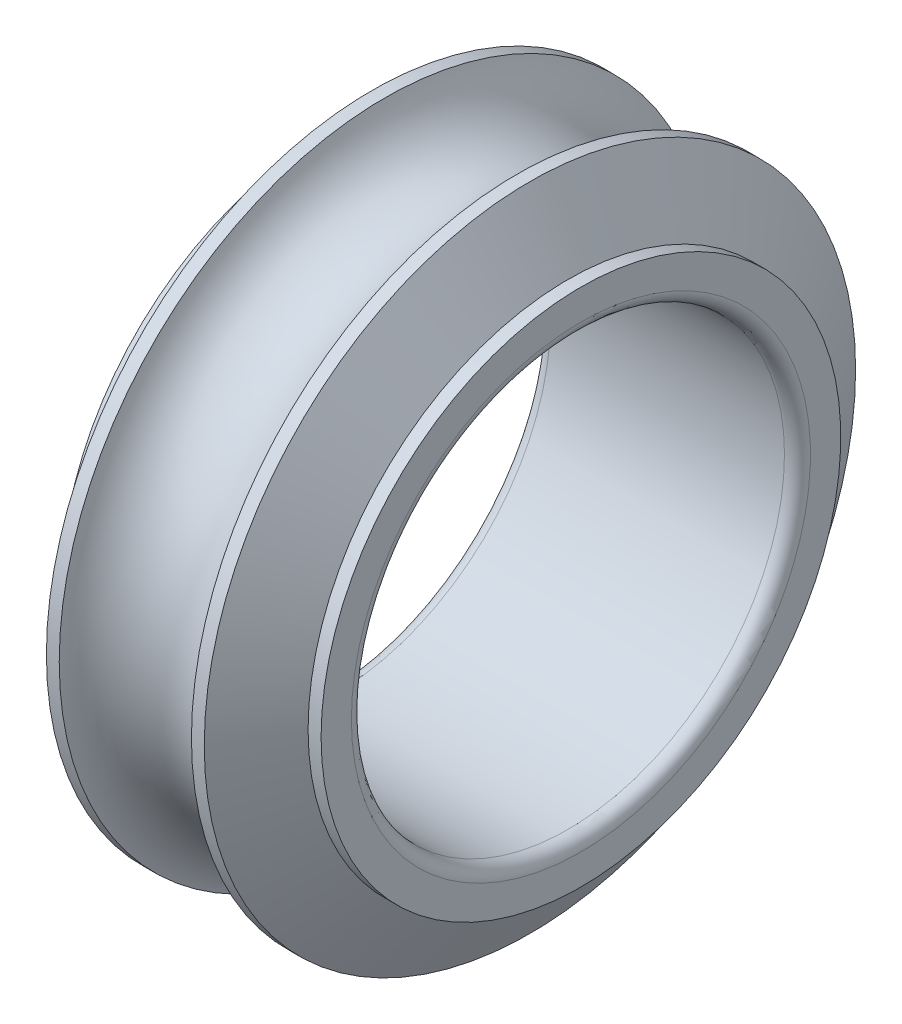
ISO-10303-21;
HEADER;
FILE_DESCRIPTION(('STEP AP214'),'2;1');
FILE_NAME('part.step','',(''),(''),'','','');
FILE_SCHEMA(('AUTOMOTIVE_DESIGN { 1 0 10303 214 1 1 1 1 }'));
ENDSEC;
DATA;
#1=APPLICATION_CONTEXT('core data for automotive mechanical design processes');
#2=APPLICATION_PROTOCOL_DEFINITION('international standard','automotive_design',2000,#1);
#3=PRODUCT_CONTEXT('',#1,'mechanical');
#4=PRODUCT('Part','Part','',(#3));
#5=PRODUCT_RELATED_PRODUCT_CATEGORY('part','',(#4));
#6=PRODUCT_DEFINITION_FORMATION('','',#4);
#7=PRODUCT_DEFINITION_CONTEXT('part definition',#1,'design');
#8=PRODUCT_DEFINITION('design','',#6,#7);
#9=PRODUCT_DEFINITION_SHAPE('','',#8);
#10=(LENGTH_UNIT() NAMED_UNIT(*) SI_UNIT(.MILLI.,.METRE.));
#11=(NAMED_UNIT(*) PLANE_ANGLE_UNIT() SI_UNIT($,.RADIAN.));
#12=(NAMED_UNIT(*) SI_UNIT($,.STERADIAN.) SOLID_ANGLE_UNIT());
#13=UNCERTAINTY_MEASURE_WITH_UNIT(LENGTH_MEASURE(1.E-05),#10,'distance_accuracy_value','');
#14=(GEOMETRIC_REPRESENTATION_CONTEXT(3) GLOBAL_UNCERTAINTY_ASSIGNED_CONTEXT((#13)) GLOBAL_UNIT_ASSIGNED_CONTEXT((#10,
#11,#12)) REPRESENTATION_CONTEXT('',''));
#15=CARTESIAN_POINT('',(0.,0.,0.));
#16=DIRECTION('',(0.,0.,1.));
#17=DIRECTION('',(1.,0.,0.));
#18=AXIS2_PLACEMENT_3D('',#15,#16,#17);
#19=CARTESIAN_POINT('',(5.7,0.,0.));
#20=DIRECTION('',(-1.,0.,0.));
#21=DIRECTION('',(0.,0.,1.));
#22=AXIS2_PLACEMENT_3D('',#19,#20,#21);
#23=TOROIDAL_SURFACE('',#22,5.3,0.3);
#24=CARTESIAN_POINT('',(6.,0.,0.));
#25=DIRECTION('',(-1.,0.,0.));
#26=DIRECTION('',(0.,0.,1.));
#27=AXIS2_PLACEMENT_3D('',#24,#25,#26);
#28=CIRCLE('',#27,5.3);
#29=CARTESIAN_POINT('',(6.,0.,5.3));
#30=VERTEX_POINT('',#29);
#31=EDGE_CURVE('E10',#30,#30,#28,.T.);
#32=ORIENTED_EDGE('',*,*,#31,.F.);
#33=EDGE_LOOP('',(#32));
#34=FACE_BOUND('',#33,.T.);
#35=CARTESIAN_POINT('',(5.7,0.,0.));
#36=DIRECTION('',(-1.,0.,0.));
#37=DIRECTION('',(0.,0.,1.));
#38=AXIS2_PLACEMENT_3D('',#35,#36,#37);
#39=CIRCLE('',#38,5.);
#40=CARTESIAN_POINT('',(5.7,0.,5.));
#41=VERTEX_POINT('',#40);
#42=EDGE_CURVE('E73',#41,#41,#39,.T.);
#43=ORIENTED_EDGE('',*,*,#42,.T.);
#44=EDGE_LOOP('',(#43));
#45=FACE_BOUND('',#44,.T.);
#46=ADVANCED_FACE('F15',(#34,#45),#23,.T.);
#47=CARTESIAN_POINT('',(6.,5.3,0.));
#48=DIRECTION('',(-1.,0.,0.));
#49=DIRECTION('',(0.,0.,1.));
#50=AXIS2_PLACEMENT_3D('',#47,#48,#49);
#51=PLANE('',#50);
#52=CARTESIAN_POINT('',(6.,0.,0.));
#53=DIRECTION('',(-1.,0.,0.));
#54=DIRECTION('',(0.,0.,1.));
#55=AXIS2_PLACEMENT_3D('',#52,#53,#54);
#56=CIRCLE('',#55,6.);
#57=CARTESIAN_POINT('',(6.,0.,6.));
#58=VERTEX_POINT('',#57);
#59=EDGE_CURVE('E22',#58,#58,#56,.T.);
#60=ORIENTED_EDGE('',*,*,#59,.F.);
#61=EDGE_LOOP('',(#60));
#62=FACE_BOUND('',#61,.T.);
#63=ORIENTED_EDGE('',*,*,#31,.T.);
#64=EDGE_LOOP('',(#63));
#65=FACE_BOUND('',#64,.T.);
#66=ADVANCED_FACE('F128',(#62,#65),#51,.F.);
#67=CARTESIAN_POINT('',(0.,0.,0.));
#68=DIRECTION('',(-1.,0.,0.));
#69=DIRECTION('',(0.,0.,1.));
#70=AXIS2_PLACEMENT_3D('',#67,#68,#69);
#71=CYLINDRICAL_SURFACE('',#70,6.);
#72=CARTESIAN_POINT('',(5.7,0.,0.));
#73=DIRECTION('',(-1.,0.,0.));
#74=DIRECTION('',(0.,0.,1.));
#75=AXIS2_PLACEMENT_3D('',#72,#73,#74);
#76=CIRCLE('',#75,6.);
#77=CARTESIAN_POINT('',(5.7,0.,6.));
#78=VERTEX_POINT('',#77);
#79=EDGE_CURVE('E31',#78,#78,#76,.T.);
#80=ORIENTED_EDGE('',*,*,#79,.F.);
#81=EDGE_LOOP('',(#80));
#82=FACE_BOUND('',#81,.T.);
#83=ORIENTED_EDGE('',*,*,#59,.T.);
#84=EDGE_LOOP('',(#83));
#85=FACE_BOUND('',#84,.T.);
#86=ADVANCED_FACE('F133',(#82,#85),#71,.T.);
#87=CARTESIAN_POINT('',(5.7,0.,0.));
#88=DIRECTION('',(-1.,0.,0.));
#89=DIRECTION('',(0.,0.,1.));
#90=AXIS2_PLACEMENT_3D('',#87,#88,#89);
#91=CONICAL_SURFACE('',#90,6.,1.0471975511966);
#92=CARTESIAN_POINT('',(4.82242759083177,0.,0.));
#93=DIRECTION('',(-1.,0.,0.));
#94=DIRECTION('',(0.,0.,1.));
#95=AXIS2_PLACEMENT_3D('',#92,#93,#94);
#96=CIRCLE('',#95,7.52);
#97=CARTESIAN_POINT('',(4.82242759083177,0.,7.52));
#98=VERTEX_POINT('',#97);
#99=EDGE_CURVE('E39',#98,#98,#96,.T.);
#100=ORIENTED_EDGE('',*,*,#99,.F.);
#101=EDGE_LOOP('',(#100));
#102=FACE_BOUND('',#101,.T.);
#103=ORIENTED_EDGE('',*,*,#79,.T.);
#104=EDGE_LOOP('',(#103));
#105=FACE_BOUND('',#104,.T.);
#106=ADVANCED_FACE('F124',(#102,#105),#91,.T.);
#107=CARTESIAN_POINT('',(0.,0.,0.));
#108=DIRECTION('',(-1.,0.,0.));
#109=DIRECTION('',(0.,0.,1.));
#110=AXIS2_PLACEMENT_3D('',#107,#108,#109);
#111=CYLINDRICAL_SURFACE('',#110,7.52);
#112=CARTESIAN_POINT('',(4.52630272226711,0.,0.));
#113=DIRECTION('',(-1.,0.,0.));
#114=DIRECTION('',(0.,0.,1.));
#115=AXIS2_PLACEMENT_3D('',#112,#113,#114);
#116=CIRCLE('',#115,7.52);
#117=CARTESIAN_POINT('',(4.52630272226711,0.,7.52));
#118=VERTEX_POINT('',#117);
#119=EDGE_CURVE('E45',#118,#118,#116,.T.);
#120=ORIENTED_EDGE('',*,*,#119,.F.);
#121=EDGE_LOOP('',(#120));
#122=FACE_BOUND('',#121,.T.);
#123=ORIENTED_EDGE('',*,*,#99,.T.);
#124=EDGE_LOOP('',(#123));
#125=FACE_BOUND('',#124,.T.);
#126=ADVANCED_FACE('F117',(#122,#125),#111,.T.);
#127=CARTESIAN_POINT('',(3.,0.,0.));
#128=DIRECTION('',(-1.,0.,0.));
#129=DIRECTION('',(0.,0.,1.));
#130=AXIS2_PLACEMENT_3D('',#127,#128,#129);
#131=TOROIDAL_SURFACE('',#130,8.,1.6);
#132=ORIENTED_EDGE('',*,*,#119,.T.);
#133=EDGE_LOOP('',(#132));
#134=FACE_BOUND('',#133,.T.);
#135=CARTESIAN_POINT('',(1.47369727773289,0.,0.));
#136=DIRECTION('',(-1.,0.,0.));
#137=DIRECTION('',(0.,0.,1.));
#138=AXIS2_PLACEMENT_3D('',#135,#136,#137);
#139=CIRCLE('',#138,7.52);
#140=CARTESIAN_POINT('',(1.47369727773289,0.,7.52));
#141=VERTEX_POINT('',#140);
#142=EDGE_CURVE('E49',#141,#141,#139,.T.);
#143=ORIENTED_EDGE('',*,*,#142,.F.);
#144=EDGE_LOOP('',(#143));
#145=FACE_BOUND('',#144,.T.);
#146=ADVANCED_FACE('F112',(#134,#145),#131,.F.);
#147=CARTESIAN_POINT('',(0.,0.,0.));
#148=DIRECTION('',(-1.,0.,0.));
#149=DIRECTION('',(0.,0.,1.));
#150=AXIS2_PLACEMENT_3D('',#147,#148,#149);
#151=CYLINDRICAL_SURFACE('',#150,7.52);
#152=CARTESIAN_POINT('',(1.17757240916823,0.,0.));
#153=DIRECTION('',(-1.,0.,0.));
#154=DIRECTION('',(0.,0.,1.));
#155=AXIS2_PLACEMENT_3D('',#152,#153,#154);
#156=CIRCLE('',#155,7.52);
#157=CARTESIAN_POINT('',(1.17757240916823,0.,7.52));
#158=VERTEX_POINT('',#157);
#159=EDGE_CURVE('E53',#158,#158,#156,.T.);
#160=ORIENTED_EDGE('',*,*,#159,.F.);
#161=EDGE_LOOP('',(#160));
#162=FACE_BOUND('',#161,.T.);
#163=ORIENTED_EDGE('',*,*,#142,.T.);
#164=EDGE_LOOP('',(#163));
#165=FACE_BOUND('',#164,.T.);
#166=ADVANCED_FACE('F106',(#162,#165),#151,.T.);
#167=CARTESIAN_POINT('',(1.17757240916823,0.,0.));
#168=DIRECTION('',(1.,0.,0.));
#169=DIRECTION('',(0.,0.,-1.));
#170=AXIS2_PLACEMENT_3D('',#167,#168,#169);
#171=CONICAL_SURFACE('',#170,7.52,1.0471975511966);
#172=CARTESIAN_POINT('',(0.3,0.,0.));
#173=DIRECTION('',(-1.,0.,0.));
#174=DIRECTION('',(0.,0.,1.));
#175=AXIS2_PLACEMENT_3D('',#172,#173,#174);
#176=CIRCLE('',#175,6.);
#177=CARTESIAN_POINT('',(0.3,0.,6.));
#178=VERTEX_POINT('',#177);
#179=EDGE_CURVE('E57',#178,#178,#176,.T.);
#180=ORIENTED_EDGE('',*,*,#179,.F.);
#181=EDGE_LOOP('',(#180));
#182=FACE_BOUND('',#181,.T.);
#183=ORIENTED_EDGE('',*,*,#159,.T.);
#184=EDGE_LOOP('',(#183));
#185=FACE_BOUND('',#184,.T.);
#186=ADVANCED_FACE('F100',(#182,#185),#171,.T.);
#187=CARTESIAN_POINT('',(0.,0.,0.));
#188=DIRECTION('',(-1.,0.,0.));
#189=DIRECTION('',(0.,0.,1.));
#190=AXIS2_PLACEMENT_3D('',#187,#188,#189);
#191=CYLINDRICAL_SURFACE('',#190,6.);
#192=CARTESIAN_POINT('',(0.,0.,0.));
#193=DIRECTION('',(-1.,0.,0.));
#194=DIRECTION('',(0.,0.,1.));
#195=AXIS2_PLACEMENT_3D('',#192,#193,#194);
#196=CIRCLE('',#195,6.);
#197=CARTESIAN_POINT('',(0.,0.,6.));
#198=VERTEX_POINT('',#197);
#199=EDGE_CURVE('E61',#198,#198,#196,.T.);
#200=ORIENTED_EDGE('',*,*,#199,.F.);
#201=EDGE_LOOP('',(#200));
#202=FACE_BOUND('',#201,.T.);
#203=ORIENTED_EDGE('',*,*,#179,.T.);
#204=EDGE_LOOP('',(#203));
#205=FACE_BOUND('',#204,.T.);
#206=ADVANCED_FACE('F94',(#202,#205),#191,.T.);
#207=CARTESIAN_POINT('',(0.,6.,0.));
#208=DIRECTION('',(1.,0.,0.));
#209=DIRECTION('',(0.,0.,-1.));
#210=AXIS2_PLACEMENT_3D('',#207,#208,#209);
#211=PLANE('',#210);
#212=CARTESIAN_POINT('',(0.,0.,0.));
#213=DIRECTION('',(-1.,0.,0.));
#214=DIRECTION('',(0.,0.,1.));
#215=AXIS2_PLACEMENT_3D('',#212,#213,#214);
#216=CIRCLE('',#215,5.3);
#217=CARTESIAN_POINT('',(0.,0.,5.3));
#218=VERTEX_POINT('',#217);
#219=EDGE_CURVE('E65',#218,#218,#216,.T.);
#220=ORIENTED_EDGE('',*,*,#219,.F.);
#221=EDGE_LOOP('',(#220));
#222=FACE_BOUND('',#221,.T.);
#223=ORIENTED_EDGE('',*,*,#199,.T.);
#224=EDGE_LOOP('',(#223));
#225=FACE_BOUND('',#224,.T.);
#226=ADVANCED_FACE('F88',(#222,#225),#211,.F.);
#227=CARTESIAN_POINT('',(0.3,0.,0.));
#228=DIRECTION('',(-1.,0.,0.));
#229=DIRECTION('',(0.,0.,1.));
#230=AXIS2_PLACEMENT_3D('',#227,#228,#229);
#231=TOROIDAL_SURFACE('',#230,5.3,0.3);
#232=CARTESIAN_POINT('',(0.3,0.,0.));
#233=DIRECTION('',(-1.,0.,0.));
#234=DIRECTION('',(0.,0.,1.));
#235=AXIS2_PLACEMENT_3D('',#232,#233,#234);
#236=CIRCLE('',#235,5.);
#237=CARTESIAN_POINT('',(0.3,0.,5.));
#238=VERTEX_POINT('',#237);
#239=EDGE_CURVE('E69',#238,#238,#236,.T.);
#240=ORIENTED_EDGE('',*,*,#239,.F.);
#241=EDGE_LOOP('',(#240));
#242=FACE_BOUND('',#241,.T.);
#243=ORIENTED_EDGE('',*,*,#219,.T.);
#244=EDGE_LOOP('',(#243));
#245=FACE_BOUND('',#244,.T.);
#246=ADVANCED_FACE('F82',(#242,#245),#231,.T.);
#247=CARTESIAN_POINT('',(0.,0.,0.));
#248=DIRECTION('',(-1.,0.,0.));
#249=DIRECTION('',(0.,0.,1.));
#250=AXIS2_PLACEMENT_3D('',#247,#248,#249);
#251=CYLINDRICAL_SURFACE('',#250,5.);
#252=ORIENTED_EDGE('',*,*,#42,.F.);
#253=EDGE_LOOP('',(#252));
#254=FACE_BOUND('',#253,.T.);
#255=ORIENTED_EDGE('',*,*,#239,.T.);
#256=EDGE_LOOP('',(#255));
#257=FACE_BOUND('',#256,.T.);
#258=ADVANCED_FACE('F79',(#254,#257),#251,.F.);
#259=CLOSED_SHELL('',(#46,#66,#86,#106,#126,#146,#166,#186,#206,#226,#246,#258));
#260=MANIFOLD_SOLID_BREP('B1',#259);
#261=ADVANCED_BREP_SHAPE_REPRESENTATION('',(#18,#260),#14);
#262=SHAPE_DEFINITION_REPRESENTATION(#9,#261);
ENDSEC;
END-ISO-10303-21;
